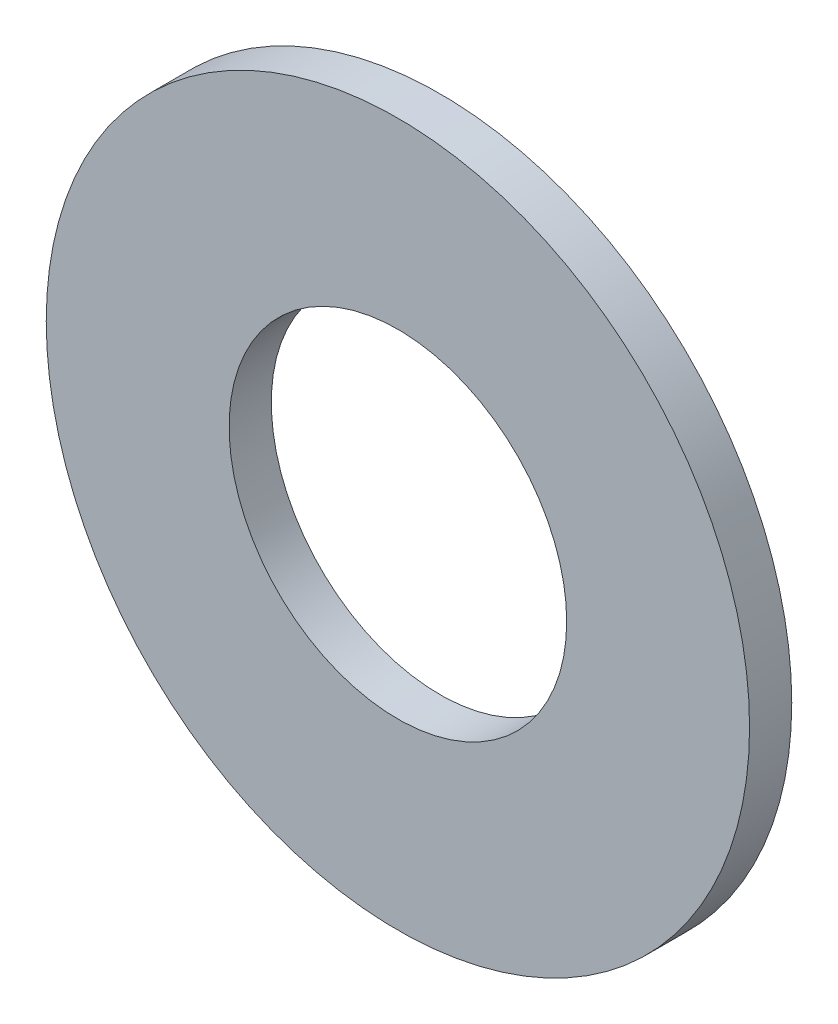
from build123d import *

# Parameters (mm, degrees)
SKETCH1_R              = 19.84375
SKETCH1_R_2            = 9.525
EXTRUDE_5906K549_DEPTH = 2.38125


with BuildPart() as part:
    # Sketch1 → Extrude 5906k549 (new body)
    with BuildSketch(Plane.XY):
        Circle(SKETCH1_R)
        Circle(SKETCH1_R_2, mode=Mode.SUBTRACT)
    extrude(amount=-EXTRUDE_5906K549_DEPTH)


solid = part.part
